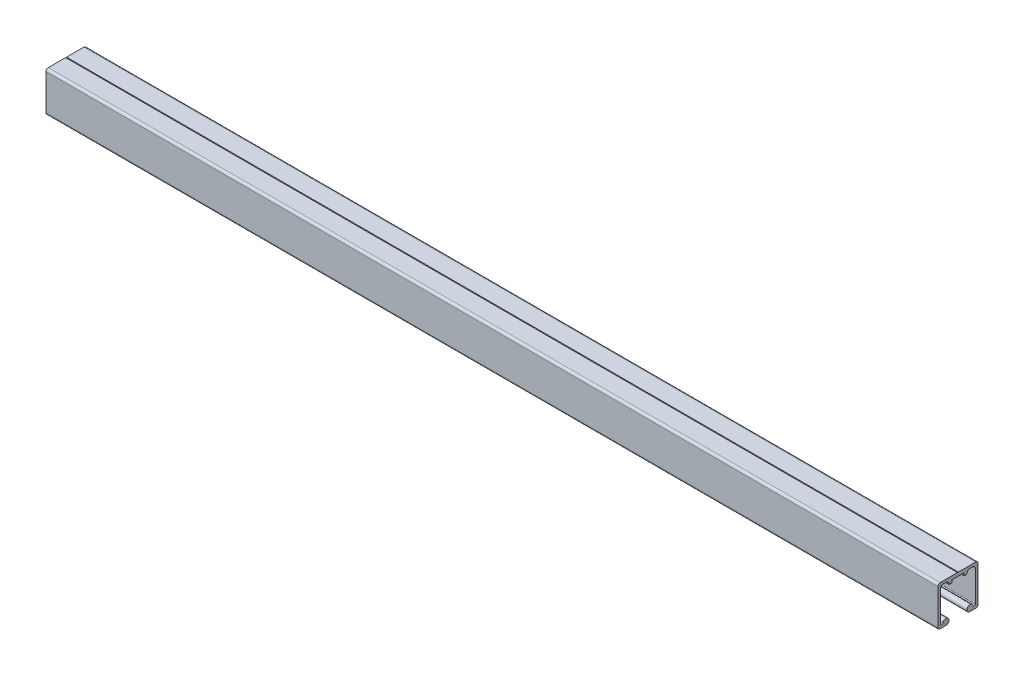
from build123d import *

# Parameters (mm, degrees)
F_45_SARJA_1_0055_LIUKUOVIPROFIILI_1_DEPTH = 1000


with BuildPart() as part:
    # Sketch118 → 45-sarja 1.0055 LIUKUOVIPROFIILI_1 (new body)
    with BuildSketch(Plane(origin=(0, 0, 0), x_dir=(0, 0, -1), z_dir=(1, 0, 0))):
        with BuildLine():
            Line((19.500000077, 16.566330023), (19.500000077, -18.183669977))
            ThreePointArc((19.500000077, -18.183669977), (18.444953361, -19.418373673), (17.06081093, -18.568805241))
            Line((17.06081093, -18.568805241), (16.829729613, -17.855291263))
            ThreePointArc((16.829729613, -17.855291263), (10.669423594, -16.875069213), (13.5, -22.433670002))
            Line((13.5, -22.433670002), (20, -22.433670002))
            ThreePointArc((20, -22.433670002), (21.767766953, -21.701436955), (22.5, -19.933670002))
            Line((22.5, -19.933670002), (22.5, 20.066329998))
            ThreePointArc((22.5, 20.066329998), (21.767766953, 21.834096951), (20, 22.566329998))
            Line((20, 22.566329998), (0.500000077, 22.566329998))
            Line((0.500000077, 22.566329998), (7.7e-08, 22.066329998))
            Line((7.7e-08, 22.066329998), (-0.499999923, 22.566329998))
            Line((-0.499999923, 22.566329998), (-20, 22.566329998))
            ThreePointArc((-20, 22.566329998), (-21.767766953, 21.834096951), (-22.5, 20.066329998))
            Line((-22.5, 20.066329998), (-22.5, -19.933670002))
            ThreePointArc((-22.5, -19.933670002), (-21.767766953, -21.701436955), (-20, -22.433670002))
            Line((-20, -22.433670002), (-13.5, -22.433670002))
            ThreePointArc((-13.5, -22.433670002), (-10.669424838, -16.875067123), (-16.829731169, -17.855295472))
            Line((-16.829731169, -17.855295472), (-17.060808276, -18.568802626))
            ThreePointArc((-17.060808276, -18.568802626), (-18.444949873, -19.418374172), (-19.499997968, -18.183670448))
            Line((-19.499997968, -18.183670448), (-19.499997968, 16.566329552))
            ThreePointArc((-19.499997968, 16.566329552), (-18.621318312, 18.687649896), (-16.499997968, 19.566329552))
            Line((-16.499997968, 19.566329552), (-13.799996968, 19.566329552))
            ThreePointArc((-13.799996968, 19.566329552), (-10.971569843, 18.394756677), (-9.799996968, 15.566329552))
            Line((-9.799996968, 15.566329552), (-6.999999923, 15.566329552))
            Line((-6.999999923, 15.566329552), (-6.799999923, 15.766329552))
            Line((-6.799999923, 15.766329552), (-6.799999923, 18.266330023))
            ThreePointArc((-6.799999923, 18.266330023), (-6.712131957, 18.478462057), (-6.499999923, 18.566330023))
            Line((-6.499999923, 18.566330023), (6.500000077, 18.566330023))
            ThreePointArc((6.500000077, 18.566330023), (6.712132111, 18.478462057), (6.800000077, 18.266330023))
            Line((6.800000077, 18.266330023), (6.800000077, 15.766330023))
            Line((6.800000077, 15.766330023), (7.000000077, 15.566330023))
            Line((7.000000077, 15.566330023), (9.800000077, 15.566330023))
            ThreePointArc((9.800000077, 15.566330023), (10.971572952, 18.394757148), (13.800000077, 19.566330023))
            Line((13.800000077, 19.566330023), (16.500000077, 19.566330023))
            ThreePointArc((16.500000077, 19.566330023), (18.621320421, 18.687650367), (19.500000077, 16.566330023))
        make_face()
    extrude(amount=F_45_SARJA_1_0055_LIUKUOVIPROFIILI_1_DEPTH)


solid = part.part
